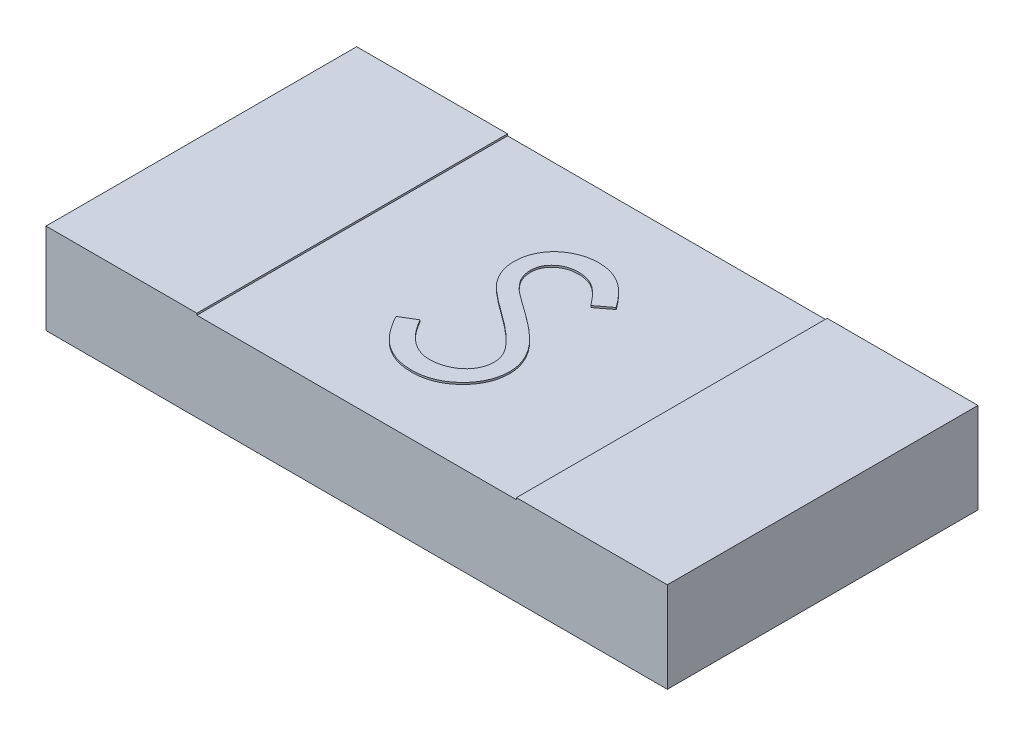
from build123d import *

# Parameters (mm, degrees)
ESQUISSE1_W        = 3.5
ESQUISSE1_H        = 1.75
BOSS_EXTRU_1_DEPTH = 0.5
ESQUISSE2_W        = 0.85
ESQUISSE2_H        = 1.75
BOSS_EXTRU_2_DEPTH = 0.01
BOSS_EXTRU_3_DEPTH = 0.01


with BuildPart() as part:
    # Esquisse1 → Boss.-Extru.1 (new body)
    with BuildSketch(Plane(origin=(0, 0, 0), x_dir=(1, 0, 0), z_dir=(0, 1, 0))):
        Rectangle(ESQUISSE1_W, ESQUISSE1_H)
    extrude(amount=BOSS_EXTRU_1_DEPTH)

    # Esquisse2 → Boss.-Extru.2 (add)
    with BuildSketch(Plane(origin=(0, 0.5, 0), x_dir=(1, 0, 0), z_dir=(0, 1, 0))):
        with Locations((-1.325, 0)):
            Rectangle(ESQUISSE2_W, ESQUISSE2_H)
        with Locations((1.325, 0)):
            Rectangle(ESQUISSE2_W, ESQUISSE2_H)
    extrude(amount=BOSS_EXTRU_2_DEPTH)

    # Esquisse3 → Boss.-Extru.3 (add)
    with BuildSketch(Plane(origin=(0, 0.5, 0), x_dir=(1, 0, 0), z_dir=(0, 1, 0))):
        with BuildLine():
            Line((-0.323499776, -0.329858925), (-0.238964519, -0.279177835))
            add(Edge.make_bspline(
                [(-0.238964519, -0.279177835), (-0.231102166, -0.292339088), (-0.2160382, -0.31755554), (-0.19090924, -0.351629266), (-0.164871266, -0.380589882), (-0.137731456, -0.404268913), (-0.109655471, -0.422911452), (-0.080460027, -0.43611209), (-0.05024351, -0.444345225), (-0.029679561, -0.44534525), (-0.019413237, -0.445844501)],
                knots=[0, 0, 0, 0, 1.272034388, 2.437168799, 3.508375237, 4.49857839, 5.41946034, 6.295179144, 7.148887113, 8, 8, 8, 8], degree=3))
            add(Edge.make_bspline(
                [(-0.019413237, -0.445844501), (-0.010645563, -0.445600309), (0.006736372, -0.445116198), (0.032325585, -0.44046454), (0.057177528, -0.433318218), (0.080779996, -0.423083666), (0.102807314, -0.410701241), (0.122123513, -0.39574519), (0.138822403, -0.37900056), (0.15248215, -0.360319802), (0.16296216, -0.340229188), (0.171017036, -0.319607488), (0.175487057, -0.298130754), (0.176160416, -0.283670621), (0.176500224, -0.276373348)],
                knots=[0, 0, 0, 0, 1.095163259, 2.171163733, 3.241058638, 4.321873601, 5.38011039, 6.391990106, 7.366004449, 8.327778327, 9.272591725, 10.192022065, 11.087607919, 12, 12, 12, 12], degree=3))
            add(Edge.make_bspline(
                [(0.176500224, -0.276373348), (0.176078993, -0.268047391), (0.17522269, -0.251121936), (0.167985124, -0.226150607), (0.156599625, -0.201438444), (0.146096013, -0.186152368), (0.140642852, -0.178216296)],
                knots=[0, 0, 0, 0, 0.938893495, 1.908633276, 2.914225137, 4, 4, 4, 4], degree=3))
            add(Edge.make_bspline(
                [(0.140642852, -0.178216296), (0.136165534, -0.172488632), (0.126765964, -0.160464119), (0.110606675, -0.14256548), (0.091644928, -0.124103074), (0.070529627, -0.104371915), (0.046491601, -0.084289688), (0.02028374, -0.062898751), (-0.008763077, -0.041012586), (-0.029134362, -0.02633471), (-0.039645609, -0.018761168)],
                knots=[0, 0, 0, 0, 0.722233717, 1.516239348, 2.393582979, 3.351407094, 4.387010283, 5.505090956, 6.712668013, 8, 8, 8, 8], degree=3))
            add(Edge.make_bspline(
                [(-0.039645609, -0.018761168), (-0.050166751, -0.011267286), (-0.070282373, 0.003060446), (-0.098413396, 0.024324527), (-0.123568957, 0.043765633), (-0.145637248, 0.061566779), (-0.164608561, 0.077730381), (-0.180632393, 0.09210122), (-0.193300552, 0.105067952), (-0.200345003, 0.113479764), (-0.203507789, 0.11725646)],
                knots=[0, 0, 0, 0, 1.452282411, 2.77665338, 3.964542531, 5.026858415, 5.96415736, 6.766646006, 7.446254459, 8, 8, 8, 8], degree=3))
            add(Edge.make_bspline(
                [(-0.203507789, 0.11725646), (-0.207928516, 0.123142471), (-0.216622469, 0.1347181), (-0.228098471, 0.152810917), (-0.237852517, 0.17133185), (-0.245498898, 0.190330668), (-0.251937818, 0.209540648), (-0.256268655, 0.229212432), (-0.258980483, 0.249257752), (-0.259258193, 0.262747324), (-0.259397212, 0.26950005)],
                knots=[0, 0, 0, 0, 1.068054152, 2.10047183, 3.106115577, 4.101338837, 5.06977816, 6.043150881, 7.020423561, 8, 8, 8, 8], degree=3))
            add(Edge.make_bspline(
                [(-0.259397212, 0.26950005), (-0.259024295, 0.280079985), (-0.258286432, 0.301013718), (-0.252046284, 0.331593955), (-0.242196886, 0.360790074), (-0.228398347, 0.388313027), (-0.210610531, 0.413446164), (-0.190025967, 0.436478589), (-0.1655084, 0.455841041), (-0.13860765, 0.472758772), (-0.109162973, 0.486000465), (-0.078308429, 0.495989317), (-0.04599498, 0.501649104), (-0.02410837, 0.502461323), (-0.013002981, 0.502873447)],
                knots=[0, 0, 0, 0, 1.005424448, 1.989358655, 2.955360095, 3.929531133, 4.905563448, 5.876582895, 6.856512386, 7.866279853, 8.892233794, 9.918561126, 10.94386622, 12, 12, 12, 12], degree=3))
            add(Edge.make_bspline(
                [(-0.013002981, 0.502873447), (-0.001218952, 0.502467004), (0.02221572, 0.501658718), (0.056686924, 0.494630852), (0.0898757, 0.483002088), (0.116573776, 0.469805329), (0.137468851, 0.456624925), (0.153403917, 0.44461926), (0.16955176, 0.430797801), (0.186042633, 0.415123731), (0.202597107, 0.39745323), (0.219460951, 0.377907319), (0.236673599, 0.356605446), (0.247746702, 0.341398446), (0.253423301, 0.333602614)],
                knots=[0, 0, 0, 0, 1.286793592, 2.559021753, 3.825965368, 5.121522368, 5.803751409, 6.523245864, 7.299691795, 8.125521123, 9.008227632, 9.944561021, 10.946284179, 12, 12, 12, 12], degree=3))
            Line((0.253423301, 0.333602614), (0.172293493, 0.272104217))
            add(Edge.make_bspline(
                [(0.172293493, 0.272104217), (0.167394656, 0.278415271), (0.157960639, 0.290568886), (0.143637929, 0.307589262), (0.130138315, 0.323136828), (0.116838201, 0.33664115), (0.10444002, 0.348841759), (0.09240658, 0.359287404), (0.080911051, 0.368080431), (0.066420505, 0.377464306), (0.048215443, 0.386766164), (0.025362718, 0.394637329), (0.001480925, 0.399367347), (-0.014784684, 0.399992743), (-0.023019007, 0.400309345)],
                knots=[0, 0, 0, 0, 1.181633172, 2.275549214, 3.290209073, 4.226197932, 5.078386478, 5.862611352, 6.581680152, 7.217281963, 8.414376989, 9.595101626, 10.782541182, 12, 12, 12, 12], degree=3))
            add(Edge.make_bspline(
                [(-0.023019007, 0.400309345), (-0.033349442, 0.399963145), (-0.053270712, 0.399295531), (-0.081553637, 0.392004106), (-0.107009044, 0.380523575), (-0.128881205, 0.364433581), (-0.14709177, 0.34537044), (-0.160264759, 0.323433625), (-0.168193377, 0.299210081), (-0.169160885, 0.282312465), (-0.169653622, 0.273706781)],
                knots=[0, 0, 0, 0, 1.14458467, 2.207223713, 3.21896685, 4.227309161, 5.202851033, 6.127160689, 7.046193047, 8, 8, 8, 8], degree=3))
            add(Edge.make_bspline(
                [(-0.169653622, 0.273706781), (-0.1695413, 0.268349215), (-0.169316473, 0.257625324), (-0.166180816, 0.241782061), (-0.162152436, 0.225978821), (-0.155768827, 0.210286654), (-0.146955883, 0.194431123), (-0.135382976, 0.178139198), (-0.120807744, 0.161267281), (-0.109642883, 0.150293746), (-0.103748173, 0.14450005)],
                knots=[0, 0, 0, 0, 0.858281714, 1.717966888, 2.583508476, 3.4729293, 4.427298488, 5.488583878, 6.674047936, 8, 8, 8, 8], degree=3))
            add(Edge.make_bspline(
                [(-0.103748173, 0.14450005), (-0.10155921, 0.142546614), (-0.096358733, 0.137905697), (-0.086851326, 0.130307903), (-0.074296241, 0.120935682), (-0.059021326, 0.109339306), (-0.040744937, 0.09588746), (-0.019465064, 0.080752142), (0.004581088, 0.063442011), (0.021644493, 0.051339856), (0.030666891, 0.044940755)],
                knots=[0, 0, 0, 0, 0.420754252, 0.999615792, 1.744751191, 2.668019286, 3.750313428, 4.999500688, 6.413464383, 8, 8, 8, 8], degree=3))
            add(Edge.make_bspline(
                [(0.030666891, 0.044940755), (0.041520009, 0.037043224), (0.062535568, 0.021750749), (0.092437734, -0.00122516), (0.11955025, -0.023695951), (0.143968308, -0.045518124), (0.165933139, -0.066526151), (0.18520106, -0.086972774), (0.201968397, -0.106711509), (0.220019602, -0.132017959), (0.238464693, -0.163098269), (0.254305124, -0.201177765), (0.264293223, -0.239405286), (0.265599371, -0.265098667), (0.266243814, -0.277775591)],
                knots=[0, 0, 0, 0, 1.163667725, 2.253281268, 3.268753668, 4.215851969, 5.092017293, 5.902905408, 6.650798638, 7.335211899, 8.59617414, 9.77448103, 10.901945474, 12, 12, 12, 12], degree=3))
            add(Edge.make_bspline(
                [(0.266243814, -0.277775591), (0.26605606, -0.286740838), (0.265684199, -0.304497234), (0.261409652, -0.330570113), (0.25514689, -0.355893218), (0.245707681, -0.380153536), (0.234186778, -0.403794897), (0.21956785, -0.426197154), (0.202622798, -0.447856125), (0.183184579, -0.468194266), (0.161914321, -0.486864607), (0.139433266, -0.503472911), (0.115704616, -0.517321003), (0.090857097, -0.528621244), (0.064885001, -0.537459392), (0.037797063, -0.543863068), (0.009548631, -0.547793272), (-0.009651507, -0.548201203), (-0.019413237, -0.548408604)],
                knots=[0, 0, 0, 0, 0.983748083, 1.948392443, 2.894712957, 3.844097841, 4.80183111, 5.778335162, 6.776009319, 7.81870978, 8.863265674, 9.881300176, 10.883814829, 11.87499822, 12.874611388, 13.892143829, 14.928324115, 16, 16, 16, 16], degree=3))
            add(Edge.make_bspline(
                [(-0.019413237, -0.548408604), (-0.026966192, -0.548262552), (-0.041976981, -0.547972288), (-0.06417969, -0.545406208), (-0.085933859, -0.541775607), (-0.106966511, -0.536011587), (-0.127548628, -0.529018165), (-0.147590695, -0.520407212), (-0.167102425, -0.510088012), (-0.186193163, -0.498289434), (-0.204814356, -0.484558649), (-0.222791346, -0.468566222), (-0.240713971, -0.45075322), (-0.258053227, -0.430635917), (-0.27515984, -0.408539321), (-0.291696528, -0.384256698), (-0.30800559, -0.357920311), (-0.318238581, -0.339387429), (-0.323499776, -0.329858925)],
                knots=[0, 0, 0, 0, 0.915332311, 1.819136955, 2.706846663, 3.586547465, 4.459518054, 5.340707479, 6.227863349, 7.133153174, 8.059268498, 9.028702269, 10.047606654, 11.120612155, 12.245963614, 13.433783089, 14.680604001, 16, 16, 16, 16], degree=3))
        make_face()
    extrude(amount=BOSS_EXTRU_3_DEPTH)


solid = part.part
